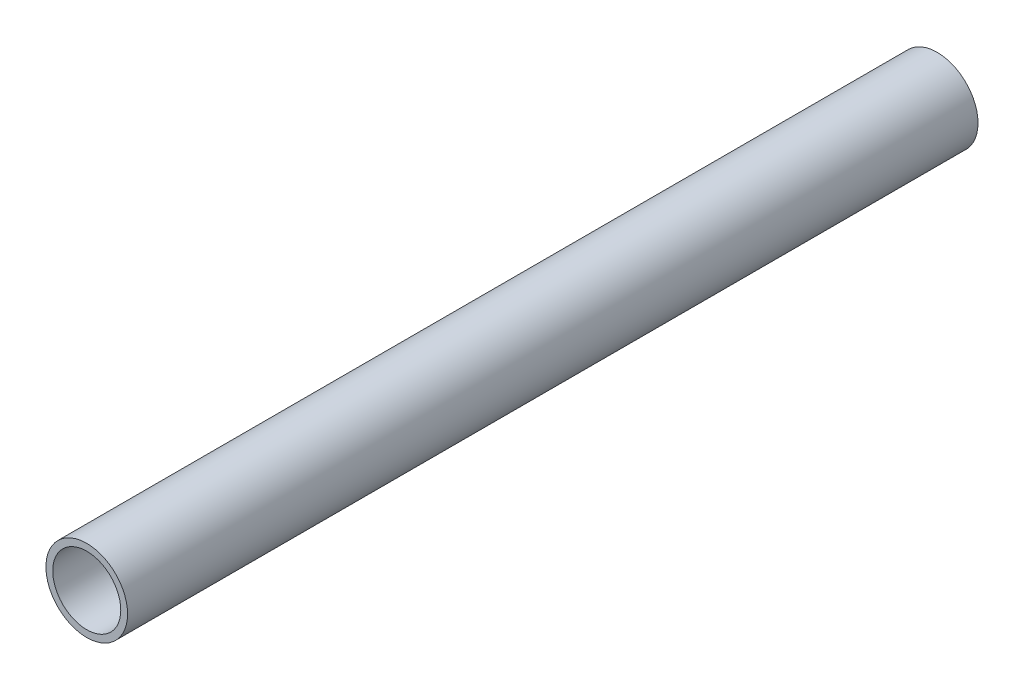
ISO-10303-21;
HEADER;
FILE_DESCRIPTION(('STEP AP214'),'2;1');
FILE_NAME('part.step','',(''),(''),'','','');
FILE_SCHEMA(('AUTOMOTIVE_DESIGN { 1 0 10303 214 1 1 1 1 }'));
ENDSEC;
DATA;
#1=APPLICATION_CONTEXT('core data for automotive mechanical design processes');
#2=APPLICATION_PROTOCOL_DEFINITION('international standard','automotive_design',2000,#1);
#3=PRODUCT_CONTEXT('',#1,'mechanical');
#4=PRODUCT('Part','Part','',(#3));
#5=PRODUCT_RELATED_PRODUCT_CATEGORY('part','',(#4));
#6=PRODUCT_DEFINITION_FORMATION('','',#4);
#7=PRODUCT_DEFINITION_CONTEXT('part definition',#1,'design');
#8=PRODUCT_DEFINITION('design','',#6,#7);
#9=PRODUCT_DEFINITION_SHAPE('','',#8);
#10=(LENGTH_UNIT() NAMED_UNIT(*) SI_UNIT(.MILLI.,.METRE.));
#11=(NAMED_UNIT(*) PLANE_ANGLE_UNIT() SI_UNIT($,.RADIAN.));
#12=(NAMED_UNIT(*) SI_UNIT($,.STERADIAN.) SOLID_ANGLE_UNIT());
#13=UNCERTAINTY_MEASURE_WITH_UNIT(LENGTH_MEASURE(1.E-05),#10,'distance_accuracy_value','');
#14=(GEOMETRIC_REPRESENTATION_CONTEXT(3) GLOBAL_UNCERTAINTY_ASSIGNED_CONTEXT((#13)) GLOBAL_UNIT_ASSIGNED_CONTEXT((#10,
#11,#12)) REPRESENTATION_CONTEXT('',''));
#15=CARTESIAN_POINT('',(0.,0.,0.));
#16=DIRECTION('',(0.,0.,1.));
#17=DIRECTION('',(1.,0.,0.));
#18=AXIS2_PLACEMENT_3D('',#15,#16,#17);
#19=CARTESIAN_POINT('',(0.,0.,625.));
#20=DIRECTION('',(0.,0.,1.));
#21=DIRECTION('',(1.,0.,0.));
#22=AXIS2_PLACEMENT_3D('',#19,#20,#21);
#23=PLANE('',#22);
#24=CARTESIAN_POINT('',(0.,0.,625.));
#25=DIRECTION('',(0.,0.,1.));
#26=DIRECTION('',(1.,0.,0.));
#27=AXIS2_PLACEMENT_3D('',#24,#25,#26);
#28=CIRCLE('',#27,30.);
#29=CARTESIAN_POINT('',(30.,0.,625.));
#30=VERTEX_POINT('',#29);
#31=EDGE_CURVE('E10',#30,#30,#28,.T.);
#32=ORIENTED_EDGE('',*,*,#31,.T.);
#33=EDGE_LOOP('',(#32));
#34=FACE_BOUND('',#33,.T.);
#35=CARTESIAN_POINT('',(0.,0.,625.));
#36=DIRECTION('',(0.,0.,1.));
#37=DIRECTION('',(1.,0.,0.));
#38=AXIS2_PLACEMENT_3D('',#35,#36,#37);
#39=CIRCLE('',#38,25.);
#40=CARTESIAN_POINT('',(25.,0.,625.));
#41=VERTEX_POINT('',#40);
#42=EDGE_CURVE('E42',#41,#41,#39,.T.);
#43=ORIENTED_EDGE('',*,*,#42,.F.);
#44=EDGE_LOOP('',(#43));
#45=FACE_BOUND('',#44,.T.);
#46=ADVANCED_FACE('F31',(#34,#45),#23,.T.);
#47=CARTESIAN_POINT('',(0.,0.,0.));
#48=DIRECTION('',(0.,0.,1.));
#49=DIRECTION('',(1.,0.,0.));
#50=AXIS2_PLACEMENT_3D('',#47,#48,#49);
#51=PLANE('',#50);
#52=CARTESIAN_POINT('',(0.,0.,0.));
#53=DIRECTION('',(0.,0.,1.));
#54=DIRECTION('',(1.,0.,0.));
#55=AXIS2_PLACEMENT_3D('',#52,#53,#54);
#56=CIRCLE('',#55,30.);
#57=CARTESIAN_POINT('',(30.,0.,0.));
#58=VERTEX_POINT('',#57);
#59=EDGE_CURVE('E38',#58,#58,#56,.T.);
#60=ORIENTED_EDGE('',*,*,#59,.F.);
#61=EDGE_LOOP('',(#60));
#62=FACE_BOUND('',#61,.T.);
#63=CARTESIAN_POINT('',(0.,0.,0.));
#64=DIRECTION('',(0.,0.,1.));
#65=DIRECTION('',(1.,0.,0.));
#66=AXIS2_PLACEMENT_3D('',#63,#64,#65);
#67=CIRCLE('',#66,25.);
#68=CARTESIAN_POINT('',(25.,0.,0.));
#69=VERTEX_POINT('',#68);
#70=EDGE_CURVE('E46',#69,#69,#67,.T.);
#71=ORIENTED_EDGE('',*,*,#70,.T.);
#72=EDGE_LOOP('',(#71));
#73=FACE_BOUND('',#72,.T.);
#74=ADVANCED_FACE('F52',(#62,#73),#51,.F.);
#75=CARTESIAN_POINT('',(0.,0.,625.));
#76=DIRECTION('',(0.,0.,-1.));
#77=DIRECTION('',(-1.,0.,0.));
#78=AXIS2_PLACEMENT_3D('',#75,#76,#77);
#79=CYLINDRICAL_SURFACE('',#78,30.);
#80=ORIENTED_EDGE('',*,*,#31,.F.);
#81=EDGE_LOOP('',(#80));
#82=FACE_BOUND('',#81,.T.);
#83=ORIENTED_EDGE('',*,*,#59,.T.);
#84=EDGE_LOOP('',(#83));
#85=FACE_BOUND('',#84,.T.);
#86=ADVANCED_FACE('F33',(#82,#85),#79,.T.);
#87=CARTESIAN_POINT('',(0.,0.,625.));
#88=DIRECTION('',(0.,0.,-1.));
#89=DIRECTION('',(-1.,0.,0.));
#90=AXIS2_PLACEMENT_3D('',#87,#88,#89);
#91=CYLINDRICAL_SURFACE('',#90,25.);
#92=ORIENTED_EDGE('',*,*,#42,.T.);
#93=EDGE_LOOP('',(#92));
#94=FACE_BOUND('',#93,.T.);
#95=ORIENTED_EDGE('',*,*,#70,.F.);
#96=EDGE_LOOP('',(#95));
#97=FACE_BOUND('',#96,.T.);
#98=ADVANCED_FACE('F54',(#94,#97),#91,.F.);
#99=CLOSED_SHELL('',(#46,#74,#86,#98));
#100=MANIFOLD_SOLID_BREP('B2',#99);
#101=ADVANCED_BREP_SHAPE_REPRESENTATION('',(#18,#100),#14);
#102=SHAPE_DEFINITION_REPRESENTATION(#9,#101);
ENDSEC;
END-ISO-10303-21;
